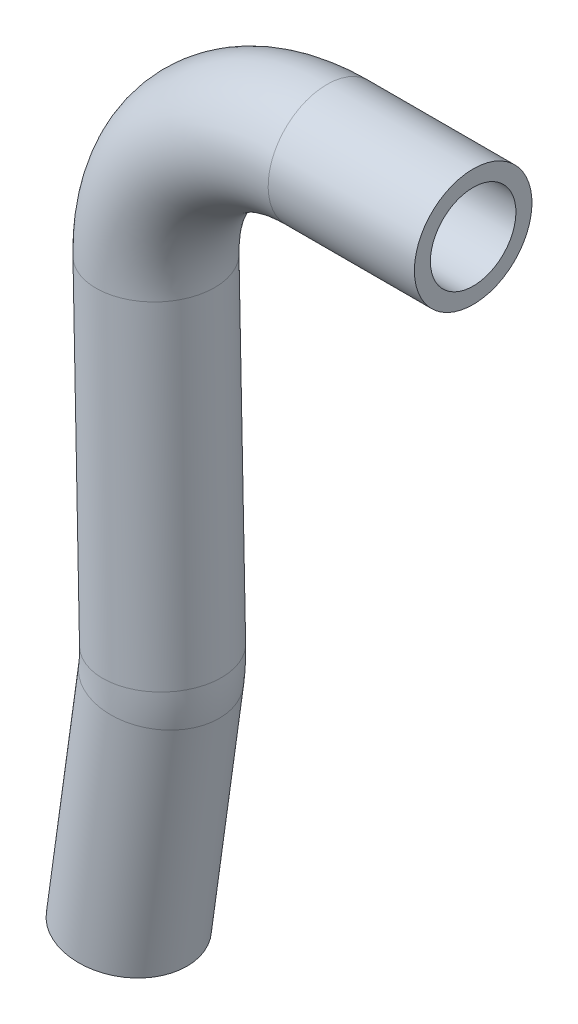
from build123d import *

# Parameters (mm, degrees)
ESQUISSE2_R   = 2.75
ESQUISSE2_R_2 = 2


with BuildPart() as part:
    # Balayage1: sweep along a path in Esquisse1
    with BuildLine(Plane.XY) as balayage1_path:
        Line((-3, -139.908105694), (-9.841910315, -139.908105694))
        ThreePointArc((-9.841910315, -139.908105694), (-15.554860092, -142.307908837), (-17.840321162, -148.067554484))
        Line((-17.840321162, -148.067554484), (-17.528339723, -163.717442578))
        ThreePointArc((-17.528339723, -163.717442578), (-17.540870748, -164.351995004), (-17.603664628, -164.983557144))
        Line((-17.603664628, -164.983557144), (-19.112019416, -175.782503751))
    # Esquisse2 → Balayage1 (sweep)
    with BuildSketch(Plane(origin=(-3, -139.908105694, 0), x_dir=(0, 0, 1), z_dir=(-1, 0, 0))):
        Circle(ESQUISSE2_R)
        Circle(ESQUISSE2_R_2, mode=Mode.SUBTRACT)
    sweep(path=balayage1_path.line)


solid = part.part
